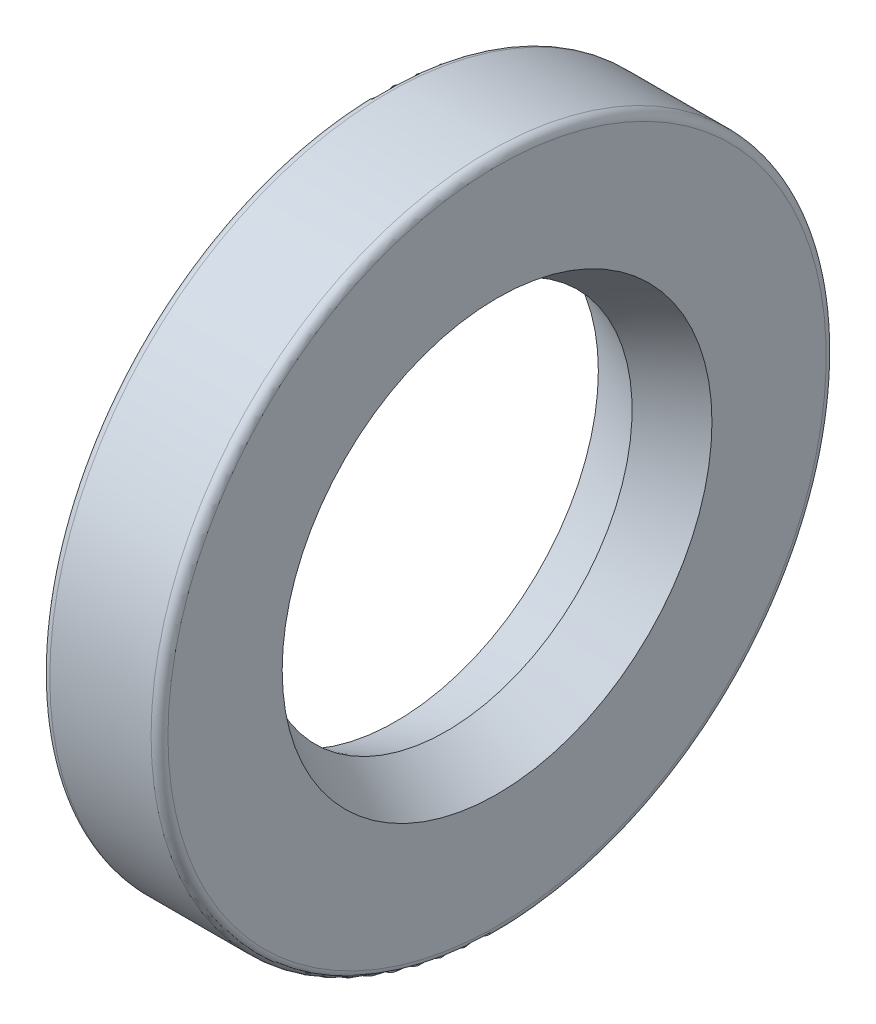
ISO-10303-21;
HEADER;
FILE_DESCRIPTION(('STEP AP214'),'2;1');
FILE_NAME('part.step','',(''),(''),'','','');
FILE_SCHEMA(('AUTOMOTIVE_DESIGN { 1 0 10303 214 1 1 1 1 }'));
ENDSEC;
DATA;
#1=APPLICATION_CONTEXT('core data for automotive mechanical design processes');
#2=APPLICATION_PROTOCOL_DEFINITION('international standard','automotive_design',2000,#1);
#3=PRODUCT_CONTEXT('',#1,'mechanical');
#4=PRODUCT('Part','Part','',(#3));
#5=PRODUCT_RELATED_PRODUCT_CATEGORY('part','',(#4));
#6=PRODUCT_DEFINITION_FORMATION('','',#4);
#7=PRODUCT_DEFINITION_CONTEXT('part definition',#1,'design');
#8=PRODUCT_DEFINITION('design','',#6,#7);
#9=PRODUCT_DEFINITION_SHAPE('','',#8);
#10=(LENGTH_UNIT() NAMED_UNIT(*) SI_UNIT(.MILLI.,.METRE.));
#11=(NAMED_UNIT(*) PLANE_ANGLE_UNIT() SI_UNIT($,.RADIAN.));
#12=(NAMED_UNIT(*) SI_UNIT($,.STERADIAN.) SOLID_ANGLE_UNIT());
#13=UNCERTAINTY_MEASURE_WITH_UNIT(LENGTH_MEASURE(1.E-05),#10,'distance_accuracy_value','');
#14=(GEOMETRIC_REPRESENTATION_CONTEXT(3) GLOBAL_UNCERTAINTY_ASSIGNED_CONTEXT((#13)) GLOBAL_UNIT_ASSIGNED_CONTEXT((#10,
#11,#12)) REPRESENTATION_CONTEXT('',''));
#15=CARTESIAN_POINT('',(0.,0.,0.));
#16=DIRECTION('',(0.,0.,1.));
#17=DIRECTION('',(1.,0.,0.));
#18=AXIS2_PLACEMENT_3D('',#15,#16,#17);
#19=CARTESIAN_POINT('',(-16.7157474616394,0.,0.));
#20=DIRECTION('',(-1.,0.,0.));
#21=DIRECTION('',(0.,0.,1.));
#22=AXIS2_PLACEMENT_3D('',#19,#20,#21);
#23=CYLINDRICAL_SURFACE('',#22,18.);
#24=CARTESIAN_POINT('',(5.,0.,0.));
#25=DIRECTION('',(-1.,0.,0.));
#26=DIRECTION('',(0.,0.,1.));
#27=AXIS2_PLACEMENT_3D('',#24,#25,#26);
#28=CIRCLE('',#27,18.);
#29=CARTESIAN_POINT('',(5.,0.,18.));
#30=VERTEX_POINT('',#29);
#31=EDGE_CURVE('E50',#30,#30,#28,.T.);
#32=ORIENTED_EDGE('',*,*,#31,.F.);
#33=EDGE_LOOP('',(#32));
#34=FACE_BOUND('',#33,.T.);
#35=CARTESIAN_POINT('',(0.,0.,0.));
#36=DIRECTION('',(-1.,0.,0.));
#37=DIRECTION('',(0.,0.,1.));
#38=AXIS2_PLACEMENT_3D('',#35,#36,#37);
#39=CIRCLE('',#38,18.);
#40=CARTESIAN_POINT('',(0.,0.,18.));
#41=VERTEX_POINT('',#40);
#42=EDGE_CURVE('E74',#41,#41,#39,.T.);
#43=ORIENTED_EDGE('',*,*,#42,.T.);
#44=EDGE_LOOP('',(#43));
#45=FACE_BOUND('',#44,.T.);
#46=ADVANCED_FACE('F30',(#34,#45),#23,.F.);
#47=CARTESIAN_POINT('',(5.,14.,0.));
#48=DIRECTION('',(1.,0.,0.));
#49=DIRECTION('',(0.,0.,-1.));
#50=AXIS2_PLACEMENT_3D('',#47,#48,#49);
#51=PLANE('',#50);
#52=CARTESIAN_POINT('',(5.,0.,0.));
#53=DIRECTION('',(-1.,0.,0.));
#54=DIRECTION('',(0.,0.,1.));
#55=AXIS2_PLACEMENT_3D('',#52,#53,#54);
#56=CIRCLE('',#55,14.);
#57=CARTESIAN_POINT('',(5.,0.,14.));
#58=VERTEX_POINT('',#57);
#59=EDGE_CURVE('E53',#58,#58,#56,.T.);
#60=ORIENTED_EDGE('',*,*,#59,.F.);
#61=EDGE_LOOP('',(#60));
#62=FACE_BOUND('',#61,.T.);
#63=ORIENTED_EDGE('',*,*,#31,.T.);
#64=EDGE_LOOP('',(#63));
#65=FACE_BOUND('',#64,.T.);
#66=ADVANCED_FACE('F93',(#62,#65),#51,.F.);
#67=CARTESIAN_POINT('',(-16.7157474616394,0.,0.));
#68=DIRECTION('',(-1.,0.,0.));
#69=DIRECTION('',(0.,0.,1.));
#70=AXIS2_PLACEMENT_3D('',#67,#68,#69);
#71=CYLINDRICAL_SURFACE('',#70,14.);
#72=CARTESIAN_POINT('',(4.,0.,0.));
#73=DIRECTION('',(-1.,0.,0.));
#74=DIRECTION('',(0.,0.,1.));
#75=AXIS2_PLACEMENT_3D('',#72,#73,#74);
#76=CIRCLE('',#75,14.);
#77=CARTESIAN_POINT('',(4.,0.,14.));
#78=VERTEX_POINT('',#77);
#79=EDGE_CURVE('E56',#78,#78,#76,.T.);
#80=ORIENTED_EDGE('',*,*,#79,.F.);
#81=EDGE_LOOP('',(#80));
#82=FACE_BOUND('',#81,.T.);
#83=ORIENTED_EDGE('',*,*,#59,.T.);
#84=EDGE_LOOP('',(#83));
#85=FACE_BOUND('',#84,.T.);
#86=ADVANCED_FACE('F99',(#82,#85),#71,.T.);
#87=CARTESIAN_POINT('',(3.,0.,0.));
#88=DIRECTION('',(-1.,0.,0.));
#89=DIRECTION('',(0.,0.,1.));
#90=AXIS2_PLACEMENT_3D('',#87,#88,#89);
#91=TOROIDAL_SURFACE('',#90,14.,1.);
#92=CARTESIAN_POINT('',(2.,0.,0.));
#93=DIRECTION('',(-1.,0.,0.));
#94=DIRECTION('',(0.,0.,1.));
#95=AXIS2_PLACEMENT_3D('',#92,#93,#94);
#96=CIRCLE('',#95,14.);
#97=CARTESIAN_POINT('',(2.,0.,14.));
#98=VERTEX_POINT('',#97);
#99=EDGE_CURVE('E59',#98,#98,#96,.T.);
#100=ORIENTED_EDGE('',*,*,#99,.F.);
#101=EDGE_LOOP('',(#100));
#102=FACE_BOUND('',#101,.T.);
#103=ORIENTED_EDGE('',*,*,#79,.T.);
#104=EDGE_LOOP('',(#103));
#105=FACE_BOUND('',#104,.T.);
#106=ADVANCED_FACE('F106',(#102,#105),#91,.T.);
#107=CARTESIAN_POINT('',(-16.7157474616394,0.,0.));
#108=DIRECTION('',(-1.,0.,0.));
#109=DIRECTION('',(0.,0.,1.));
#110=AXIS2_PLACEMENT_3D('',#107,#108,#109);
#111=CYLINDRICAL_SURFACE('',#110,14.);
#112=CARTESIAN_POINT('',(1.,0.,0.));
#113=DIRECTION('',(-1.,0.,0.));
#114=DIRECTION('',(0.,0.,1.));
#115=AXIS2_PLACEMENT_3D('',#112,#113,#114);
#116=CIRCLE('',#115,14.);
#117=CARTESIAN_POINT('',(1.,0.,14.));
#118=VERTEX_POINT('',#117);
#119=EDGE_CURVE('E62',#118,#118,#116,.T.);
#120=ORIENTED_EDGE('',*,*,#119,.F.);
#121=EDGE_LOOP('',(#120));
#122=FACE_BOUND('',#121,.T.);
#123=ORIENTED_EDGE('',*,*,#99,.T.);
#124=EDGE_LOOP('',(#123));
#125=FACE_BOUND('',#124,.T.);
#126=ADVANCED_FACE('F110',(#122,#125),#111,.T.);
#127=CARTESIAN_POINT('',(1.,14.,0.));
#128=DIRECTION('',(1.,0.,0.));
#129=DIRECTION('',(0.,0.,-1.));
#130=AXIS2_PLACEMENT_3D('',#127,#128,#129);
#131=PLANE('',#130);
#132=CARTESIAN_POINT('',(1.,0.,0.));
#133=DIRECTION('',(-1.,0.,0.));
#134=DIRECTION('',(0.,0.,1.));
#135=AXIS2_PLACEMENT_3D('',#132,#133,#134);
#136=CIRCLE('',#135,12.);
#137=CARTESIAN_POINT('',(1.,0.,12.));
#138=VERTEX_POINT('',#137);
#139=EDGE_CURVE('E65',#138,#138,#136,.T.);
#140=ORIENTED_EDGE('',*,*,#139,.F.);
#141=EDGE_LOOP('',(#140));
#142=FACE_BOUND('',#141,.T.);
#143=ORIENTED_EDGE('',*,*,#119,.T.);
#144=EDGE_LOOP('',(#143));
#145=FACE_BOUND('',#144,.T.);
#146=ADVANCED_FACE('F114',(#142,#145),#131,.F.);
#147=CARTESIAN_POINT('',(1.,0.,0.));
#148=DIRECTION('',(-1.,0.,0.));
#149=DIRECTION('',(0.,0.,1.));
#150=AXIS2_PLACEMENT_3D('',#147,#148,#149);
#151=CONICAL_SURFACE('',#150,12.,0.321750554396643);
#152=CARTESIAN_POINT('',(4.,0.,0.));
#153=DIRECTION('',(-1.,0.,0.));
#154=DIRECTION('',(0.,0.,1.));
#155=AXIS2_PLACEMENT_3D('',#152,#153,#154);
#156=CIRCLE('',#155,11.);
#157=CARTESIAN_POINT('',(4.,0.,11.));
#158=VERTEX_POINT('',#157);
#159=EDGE_CURVE('E68',#158,#158,#156,.T.);
#160=ORIENTED_EDGE('',*,*,#159,.F.);
#161=EDGE_LOOP('',(#160));
#162=FACE_BOUND('',#161,.T.);
#163=ORIENTED_EDGE('',*,*,#139,.T.);
#164=EDGE_LOOP('',(#163));
#165=FACE_BOUND('',#164,.T.);
#166=ADVANCED_FACE('F118',(#162,#165),#151,.F.);
#167=CARTESIAN_POINT('',(4.,0.,0.));
#168=DIRECTION('',(1.,0.,0.));
#169=DIRECTION('',(0.,0.,-1.));
#170=AXIS2_PLACEMENT_3D('',#167,#168,#169);
#171=CONICAL_SURFACE('',#170,11.,0.523598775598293);
#172=CARTESIAN_POINT('',(7.,0.,0.));
#173=DIRECTION('',(-1.,0.,0.));
#174=DIRECTION('',(0.,0.,1.));
#175=AXIS2_PLACEMENT_3D('',#172,#173,#174);
#176=CIRCLE('',#175,12.7320508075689);
#177=CARTESIAN_POINT('',(7.,0.,12.7320508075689));
#178=VERTEX_POINT('',#177);
#179=EDGE_CURVE('E71',#178,#178,#176,.T.);
#180=ORIENTED_EDGE('',*,*,#179,.F.);
#181=EDGE_LOOP('',(#180));
#182=FACE_BOUND('',#181,.T.);
#183=ORIENTED_EDGE('',*,*,#159,.T.);
#184=EDGE_LOOP('',(#183));
#185=FACE_BOUND('',#184,.T.);
#186=ADVANCED_FACE('F122',(#182,#185),#171,.F.);
#187=CARTESIAN_POINT('',(7.,20.,0.));
#188=DIRECTION('',(-1.,0.,0.));
#189=DIRECTION('',(0.,0.,1.));
#190=AXIS2_PLACEMENT_3D('',#187,#188,#189);
#191=PLANE('',#190);
#192=CARTESIAN_POINT('',(7.,0.,0.));
#193=DIRECTION('',(-1.,0.,0.));
#194=DIRECTION('',(0.,0.,1.));
#195=AXIS2_PLACEMENT_3D('',#192,#193,#194);
#196=CIRCLE('',#195,19.5);
#197=CARTESIAN_POINT('',(7.,0.,19.5));
#198=VERTEX_POINT('',#197);
#199=EDGE_CURVE('E10',#198,#198,#196,.F.);
#200=ORIENTED_EDGE('',*,*,#199,.T.);
#201=EDGE_LOOP('',(#200));
#202=FACE_BOUND('',#201,.T.);
#203=ORIENTED_EDGE('',*,*,#179,.T.);
#204=EDGE_LOOP('',(#203));
#205=FACE_BOUND('',#204,.T.);
#206=ADVANCED_FACE('F90',(#202,#205),#191,.F.);
#207=CARTESIAN_POINT('',(-16.7157474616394,0.,0.));
#208=DIRECTION('',(-1.,0.,0.));
#209=DIRECTION('',(0.,0.,1.));
#210=AXIS2_PLACEMENT_3D('',#207,#208,#209);
#211=CYLINDRICAL_SURFACE('',#210,20.);
#212=CARTESIAN_POINT('',(0.5,0.,0.));
#213=DIRECTION('',(1.,0.,0.));
#214=DIRECTION('',(0.,0.,-1.));
#215=AXIS2_PLACEMENT_3D('',#212,#213,#214);
#216=CIRCLE('',#215,20.);
#217=CARTESIAN_POINT('',(0.5,0.,-20.));
#218=VERTEX_POINT('',#217);
#219=EDGE_CURVE('E37',#218,#218,#216,.T.);
#220=ORIENTED_EDGE('',*,*,#219,.T.);
#221=EDGE_LOOP('',(#220));
#222=FACE_BOUND('',#221,.T.);
#223=CARTESIAN_POINT('',(6.5,0.,0.));
#224=DIRECTION('',(-1.,0.,0.));
#225=DIRECTION('',(0.,0.,1.));
#226=AXIS2_PLACEMENT_3D('',#223,#224,#225);
#227=CIRCLE('',#226,20.);
#228=CARTESIAN_POINT('',(6.5,0.,20.));
#229=VERTEX_POINT('',#228);
#230=EDGE_CURVE('E41',#229,#229,#227,.T.);
#231=ORIENTED_EDGE('',*,*,#230,.T.);
#232=EDGE_LOOP('',(#231));
#233=FACE_BOUND('',#232,.T.);
#234=ADVANCED_FACE('F82',(#222,#233),#211,.T.);
#235=CARTESIAN_POINT('',(0.,18.,0.));
#236=DIRECTION('',(1.,0.,0.));
#237=DIRECTION('',(0.,0.,-1.));
#238=AXIS2_PLACEMENT_3D('',#235,#236,#237);
#239=PLANE('',#238);
#240=CARTESIAN_POINT('',(0.,0.,0.));
#241=DIRECTION('',(1.,0.,0.));
#242=DIRECTION('',(0.,0.,-1.));
#243=AXIS2_PLACEMENT_3D('',#240,#241,#242);
#244=CIRCLE('',#243,19.5);
#245=CARTESIAN_POINT('',(0.,0.,-19.5));
#246=VERTEX_POINT('',#245);
#247=EDGE_CURVE('E45',#246,#246,#244,.F.);
#248=ORIENTED_EDGE('',*,*,#247,.T.);
#249=EDGE_LOOP('',(#248));
#250=FACE_BOUND('',#249,.T.);
#251=ORIENTED_EDGE('',*,*,#42,.F.);
#252=EDGE_LOOP('',(#251));
#253=FACE_BOUND('',#252,.T.);
#254=ADVANCED_FACE('F79',(#250,#253),#239,.F.);
#255=CARTESIAN_POINT('',(0.5,0.,0.));
#256=DIRECTION('',(1.,0.,0.));
#257=DIRECTION('',(0.,0.,-1.));
#258=AXIS2_PLACEMENT_3D('',#255,#256,#257);
#259=TOROIDAL_SURFACE('',#258,19.5,0.5);
#260=ORIENTED_EDGE('',*,*,#219,.F.);
#261=EDGE_LOOP('',(#260));
#262=FACE_BOUND('',#261,.T.);
#263=ORIENTED_EDGE('',*,*,#247,.F.);
#264=EDGE_LOOP('',(#263));
#265=FACE_BOUND('',#264,.T.);
#266=ADVANCED_FACE('F81',(#262,#265),#259,.T.);
#267=CARTESIAN_POINT('',(6.5,0.,0.));
#268=DIRECTION('',(-1.,0.,0.));
#269=DIRECTION('',(0.,0.,1.));
#270=AXIS2_PLACEMENT_3D('',#267,#268,#269);
#271=TOROIDAL_SURFACE('',#270,19.5,0.5);
#272=ORIENTED_EDGE('',*,*,#199,.F.);
#273=EDGE_LOOP('',(#272));
#274=FACE_BOUND('',#273,.T.);
#275=ORIENTED_EDGE('',*,*,#230,.F.);
#276=EDGE_LOOP('',(#275));
#277=FACE_BOUND('',#276,.T.);
#278=ADVANCED_FACE('F32',(#274,#277),#271,.T.);
#279=CLOSED_SHELL('',(#46,#66,#86,#106,#126,#146,#166,#186,#206,#234,#254,#266,#278));
#280=MANIFOLD_SOLID_BREP('B2',#279);
#281=ADVANCED_BREP_SHAPE_REPRESENTATION('',(#18,#280),#14);
#282=SHAPE_DEFINITION_REPRESENTATION(#9,#281);
ENDSEC;
END-ISO-10303-21;
